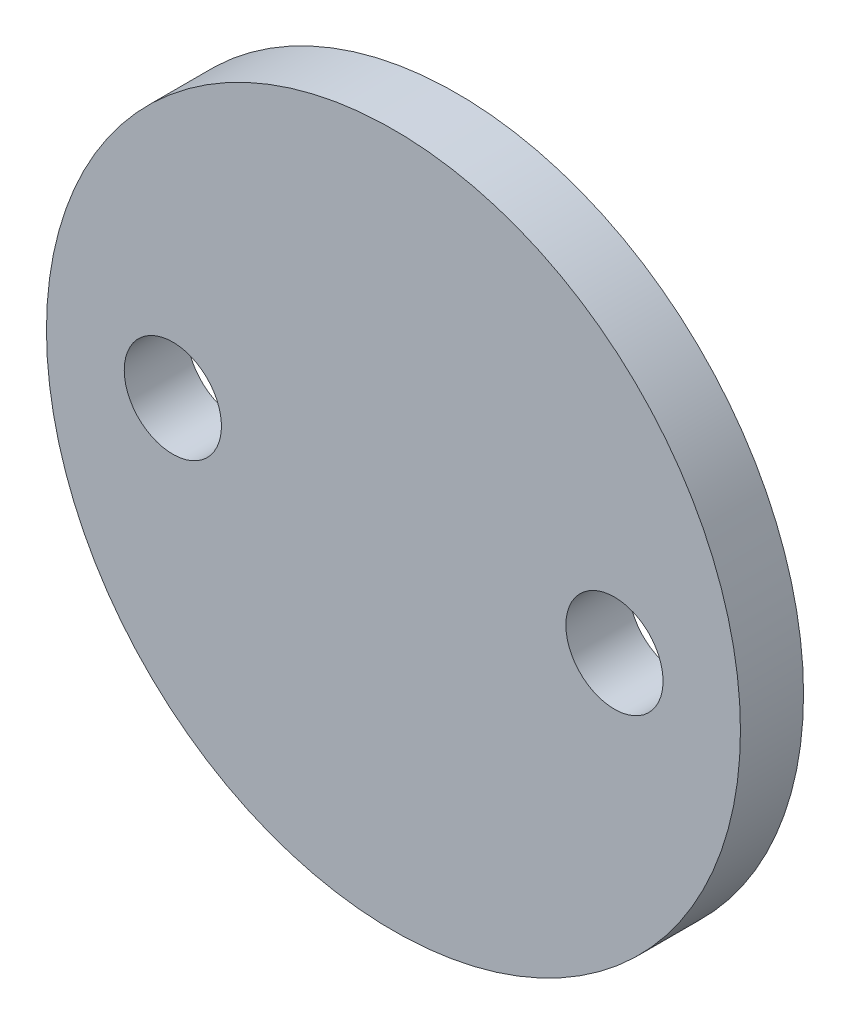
ISO-10303-21;
HEADER;
FILE_DESCRIPTION(('STEP AP214'),'2;1');
FILE_NAME('part.step','',(''),(''),'','','');
FILE_SCHEMA(('AUTOMOTIVE_DESIGN { 1 0 10303 214 1 1 1 1 }'));
ENDSEC;
DATA;
#1=APPLICATION_CONTEXT('core data for automotive mechanical design processes');
#2=APPLICATION_PROTOCOL_DEFINITION('international standard','automotive_design',2000,#1);
#3=PRODUCT_CONTEXT('',#1,'mechanical');
#4=PRODUCT('Part','Part','',(#3));
#5=PRODUCT_RELATED_PRODUCT_CATEGORY('part','',(#4));
#6=PRODUCT_DEFINITION_FORMATION('','',#4);
#7=PRODUCT_DEFINITION_CONTEXT('part definition',#1,'design');
#8=PRODUCT_DEFINITION('design','',#6,#7);
#9=PRODUCT_DEFINITION_SHAPE('','',#8);
#10=(LENGTH_UNIT() NAMED_UNIT(*) SI_UNIT(.MILLI.,.METRE.));
#11=(NAMED_UNIT(*) PLANE_ANGLE_UNIT() SI_UNIT($,.RADIAN.));
#12=(NAMED_UNIT(*) SI_UNIT($,.STERADIAN.) SOLID_ANGLE_UNIT());
#13=UNCERTAINTY_MEASURE_WITH_UNIT(LENGTH_MEASURE(1.E-05),#10,'distance_accuracy_value','');
#14=(GEOMETRIC_REPRESENTATION_CONTEXT(3) GLOBAL_UNCERTAINTY_ASSIGNED_CONTEXT((#13)) GLOBAL_UNIT_ASSIGNED_CONTEXT((#10,
#11,#12)) REPRESENTATION_CONTEXT('',''));
#15=CARTESIAN_POINT('',(0.,0.,0.));
#16=DIRECTION('',(0.,0.,1.));
#17=DIRECTION('',(1.,0.,0.));
#18=AXIS2_PLACEMENT_3D('',#15,#16,#17);
#19=CARTESIAN_POINT('',(0.,0.,3.175));
#20=DIRECTION('',(0.,0.,-1.));
#21=DIRECTION('',(-1.,0.,0.));
#22=AXIS2_PLACEMENT_3D('',#19,#20,#21);
#23=CYLINDRICAL_SURFACE('',#22,17.4625);
#24=CARTESIAN_POINT('',(0.,0.,3.175));
#25=DIRECTION('',(0.,0.,1.));
#26=DIRECTION('',(1.,0.,0.));
#27=AXIS2_PLACEMENT_3D('',#24,#25,#26);
#28=CIRCLE('',#27,17.4625);
#29=CARTESIAN_POINT('',(17.4625,0.,3.175));
#30=VERTEX_POINT('',#29);
#31=EDGE_CURVE('E10',#30,#30,#28,.T.);
#32=ORIENTED_EDGE('',*,*,#31,.F.);
#33=EDGE_LOOP('',(#32));
#34=FACE_BOUND('',#33,.T.);
#35=CARTESIAN_POINT('',(0.,0.,0.));
#36=DIRECTION('',(0.,0.,1.));
#37=DIRECTION('',(1.,0.,0.));
#38=AXIS2_PLACEMENT_3D('',#35,#36,#37);
#39=CIRCLE('',#38,17.4625);
#40=CARTESIAN_POINT('',(17.4625,0.,0.));
#41=VERTEX_POINT('',#40);
#42=EDGE_CURVE('E35',#41,#41,#39,.T.);
#43=ORIENTED_EDGE('',*,*,#42,.T.);
#44=EDGE_LOOP('',(#43));
#45=FACE_BOUND('',#44,.T.);
#46=ADVANCED_FACE('F29',(#34,#45),#23,.T.);
#47=CARTESIAN_POINT('',(0.,0.,3.175));
#48=DIRECTION('',(0.,0.,1.));
#49=DIRECTION('',(1.,0.,0.));
#50=AXIS2_PLACEMENT_3D('',#47,#48,#49);
#51=PLANE('',#50);
#52=CARTESIAN_POINT('',(-11.1032424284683,0.20507568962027,3.175));
#53=DIRECTION('',(0.,0.,-1.));
#54=DIRECTION('',(-1.,0.,0.));
#55=AXIS2_PLACEMENT_3D('',#52,#53,#54);
#56=CIRCLE('',#55,2.44475);
#57=CARTESIAN_POINT('',(-13.5479924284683,0.20507568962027,3.175));
#58=VERTEX_POINT('',#57);
#59=EDGE_CURVE('E48',#58,#58,#56,.T.);
#60=ORIENTED_EDGE('',*,*,#59,.T.);
#61=EDGE_LOOP('',(#60));
#62=FACE_BOUND('',#61,.T.);
#63=CARTESIAN_POINT('',(11.1217575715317,0.205075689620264,3.175));
#64=DIRECTION('',(0.,0.,-1.));
#65=DIRECTION('',(-1.,0.,0.));
#66=AXIS2_PLACEMENT_3D('',#63,#64,#65);
#67=CIRCLE('',#66,2.44475);
#68=CARTESIAN_POINT('',(8.67700757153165,0.205075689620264,3.175));
#69=VERTEX_POINT('',#68);
#70=EDGE_CURVE('E39',#69,#69,#67,.T.);
#71=ORIENTED_EDGE('',*,*,#70,.T.);
#72=EDGE_LOOP('',(#71));
#73=FACE_BOUND('',#72,.T.);
#74=ORIENTED_EDGE('',*,*,#31,.T.);
#75=EDGE_LOOP('',(#74));
#76=FACE_BOUND('',#75,.T.);
#77=ADVANCED_FACE('F61',(#62,#73,#76),#51,.T.);
#78=CARTESIAN_POINT('',(0.,0.,0.));
#79=DIRECTION('',(0.,0.,1.));
#80=DIRECTION('',(1.,0.,0.));
#81=AXIS2_PLACEMENT_3D('',#78,#79,#80);
#82=PLANE('',#81);
#83=CARTESIAN_POINT('',(-11.1032424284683,0.20507568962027,0.));
#84=DIRECTION('',(0.,0.,-1.));
#85=DIRECTION('',(-1.,0.,0.));
#86=AXIS2_PLACEMENT_3D('',#83,#84,#85);
#87=CIRCLE('',#86,2.44475);
#88=CARTESIAN_POINT('',(-13.5479924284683,0.20507568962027,0.));
#89=VERTEX_POINT('',#88);
#90=EDGE_CURVE('E51',#89,#89,#87,.T.);
#91=ORIENTED_EDGE('',*,*,#90,.F.);
#92=EDGE_LOOP('',(#91));
#93=FACE_BOUND('',#92,.T.);
#94=CARTESIAN_POINT('',(11.1217575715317,0.205075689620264,0.));
#95=DIRECTION('',(0.,0.,-1.));
#96=DIRECTION('',(-1.,0.,0.));
#97=AXIS2_PLACEMENT_3D('',#94,#95,#96);
#98=CIRCLE('',#97,2.44475);
#99=CARTESIAN_POINT('',(8.67700757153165,0.205075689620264,0.));
#100=VERTEX_POINT('',#99);
#101=EDGE_CURVE('E43',#100,#100,#98,.T.);
#102=ORIENTED_EDGE('',*,*,#101,.F.);
#103=EDGE_LOOP('',(#102));
#104=FACE_BOUND('',#103,.T.);
#105=ORIENTED_EDGE('',*,*,#42,.F.);
#106=EDGE_LOOP('',(#105));
#107=FACE_BOUND('',#106,.T.);
#108=ADVANCED_FACE('F57',(#93,#104,#107),#82,.F.);
#109=CARTESIAN_POINT('',(11.1217575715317,0.205075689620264,3.175));
#110=DIRECTION('',(0.,0.,-1.));
#111=DIRECTION('',(-1.,0.,0.));
#112=AXIS2_PLACEMENT_3D('',#109,#110,#111);
#113=CYLINDRICAL_SURFACE('',#112,2.44475);
#114=ORIENTED_EDGE('',*,*,#70,.F.);
#115=EDGE_LOOP('',(#114));
#116=FACE_BOUND('',#115,.T.);
#117=ORIENTED_EDGE('',*,*,#101,.T.);
#118=EDGE_LOOP('',(#117));
#119=FACE_BOUND('',#118,.T.);
#120=ADVANCED_FACE('F60',(#116,#119),#113,.F.);
#121=CARTESIAN_POINT('',(-11.1032424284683,0.20507568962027,3.175));
#122=DIRECTION('',(0.,0.,-1.));
#123=DIRECTION('',(-1.,0.,0.));
#124=AXIS2_PLACEMENT_3D('',#121,#122,#123);
#125=CYLINDRICAL_SURFACE('',#124,2.44475);
#126=ORIENTED_EDGE('',*,*,#59,.F.);
#127=EDGE_LOOP('',(#126));
#128=FACE_BOUND('',#127,.T.);
#129=ORIENTED_EDGE('',*,*,#90,.T.);
#130=EDGE_LOOP('',(#129));
#131=FACE_BOUND('',#130,.T.);
#132=ADVANCED_FACE('F55',(#128,#131),#125,.F.);
#133=CLOSED_SHELL('',(#46,#77,#108,#120,#132));
#134=MANIFOLD_SOLID_BREP('B2',#133);
#135=ADVANCED_BREP_SHAPE_REPRESENTATION('',(#18,#134),#14);
#136=SHAPE_DEFINITION_REPRESENTATION(#9,#135);
ENDSEC;
END-ISO-10303-21;
